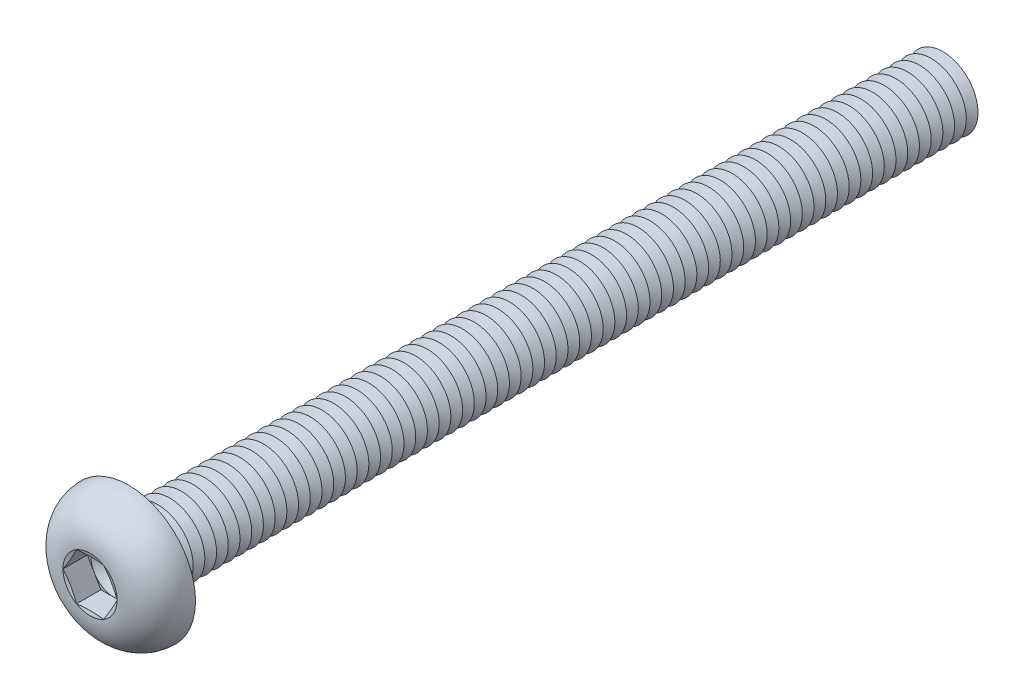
from build123d import *

# Parameters (mm, degrees)
FILLET1_R          = 0.25
LPATTERN1_COUNT    = 70
LPATTERN1_PITCH    = 0.5
CUT_EXTRUDE1_DEPTH = 1.04


with BuildPart() as part:
    # Sketch1 → Revolve1 (revolve)
    with BuildSketch(Plane(origin=(0, 0, 0), x_dir=(0, 0, -1), z_dir=(1, 0, 0))):
        with BuildLine():
            Line((0, 1.5), (0, 2.85))
            ThreePointArc((0, 2.85), (-1.182850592, 2.35063849), (-1.65, 1.1547))
            Line((-1.65, 1.1547), (-1.495299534, 0.57735))
            Line((-1.495299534, 0.57735), (-1.65, 0.57735))
            Line((-1.65, 0.57735), (-1.65, 0))
            Line((-1.65, 0), (35, 0))
            Line((35, 0), (35, 1.5))
            Line((35, 1.5), (0, 1.5))
        make_face()
    revolve(axis=Axis((0, 0, -35), (0, 0, 1)))

    # Fillet1
    fillet1_edges = [part.edges().sort_by_distance(p)[0] for p in [
        (0, -1.5, 0),
    ]]
    fillet(fillet1_edges, radius=FILLET1_R)

    # Sketch2 → Cut-Revolve1 (revolve, cut)
    with BuildSketch(Plane(origin=(0, 0, 0), x_dir=(0, 0, -1), z_dir=(1, 0, 0))):
        Polygon((34.75, 1.5), (35.25, 1.5), (35, 1.066987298), align=None)
    cut_revolve1 = revolve(axis=Axis((0, 0, -35), (0, 0, -1)), mode=Mode.SUBTRACT)

    # LPattern1: Cut-Revolve1 ×70
    with Locations(*[(0, 0, i * LPATTERN1_PITCH) for i in range(1, LPATTERN1_COUNT)]):
        add(cut_revolve1, mode=Mode.SUBTRACT)

    # Sketch3 → Cut-Extrude1 (cut)
    with BuildSketch(Plane.XY.offset(1.65)):
        Polygon((0.57735, 0.999999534), (-0.57735, 0.999999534), (-1.1547, 0), (-0.57735, -0.999999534), (0.57735, -0.999999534), (1.1547, 0), align=None)
    extrude(amount=-CUT_EXTRUDE1_DEPTH, mode=Mode.SUBTRACT)

    # Cut-Extrude2 cone 1 section (on through the dimple's axis) → Cut-Extrude2 (revolve, cut)
    with BuildSketch(Plane(origin=(0, 0, 0.61), x_dir=(0, -1, 0), z_dir=(1, 0, 0))):
        Polygon((0, 0), (0.999999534, 0), (0, 0.57735), align=None)
    revolve(axis=Axis((0, 0, 0.61), (0, 0, -1)), mode=Mode.SUBTRACT)


solid = part.part
